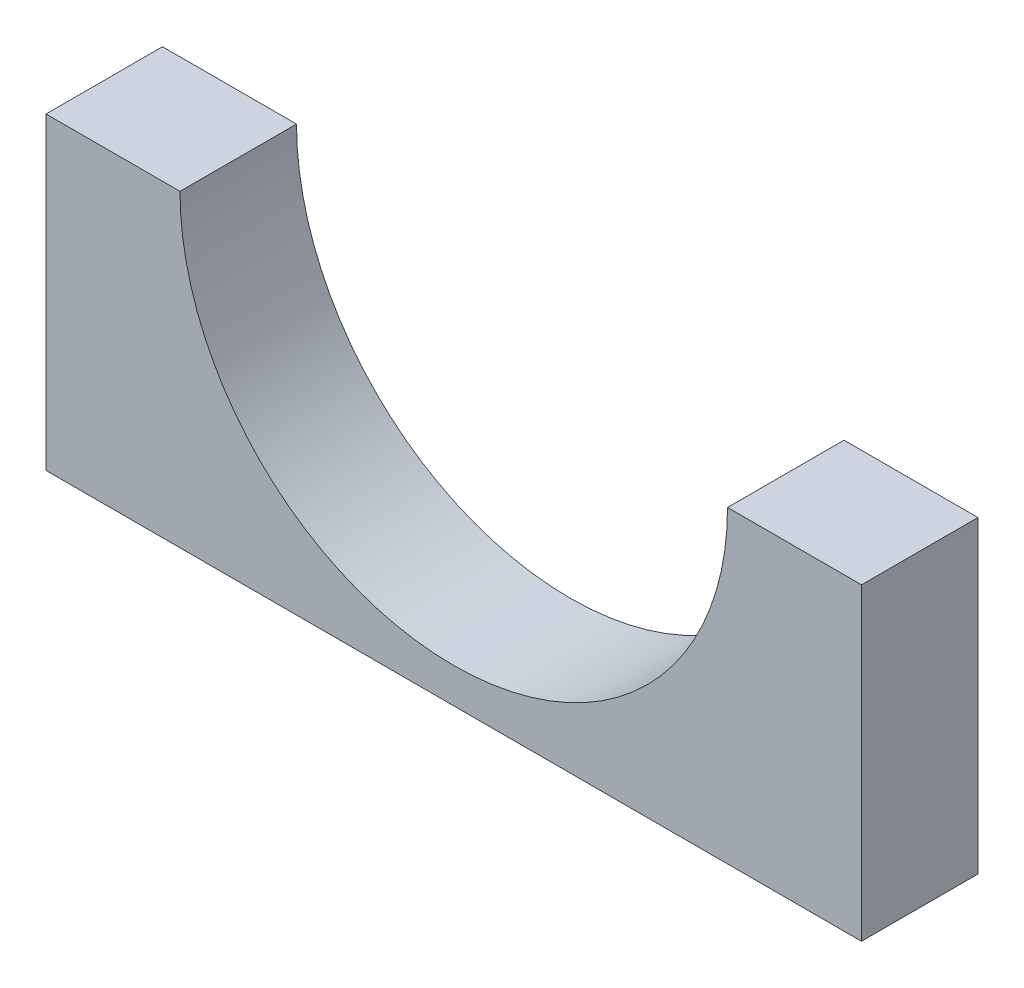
from build123d import *

# Parameters (mm, degrees)
EXTRUSION1_DEPTH = 10


with BuildPart() as part:
    # Esquisse1 → Extrusion1 (new body)
    with BuildSketch(Plane.XY):
        with BuildLine():
            Line((-50.5, -25), (-39, -25))
            Line((-39, -25), (-39, -51.5))
            Line((-39, -51.5), (-109, -51.5))
            Line((-109, -51.5), (-109, -25))
            Line((-109, -25), (-97.5, -25))
            ThreePointArc((-97.5, -25), (-74, -48.5), (-50.5, -25))
        make_face()
    extrude(amount=-EXTRUSION1_DEPTH)


solid = part.part
